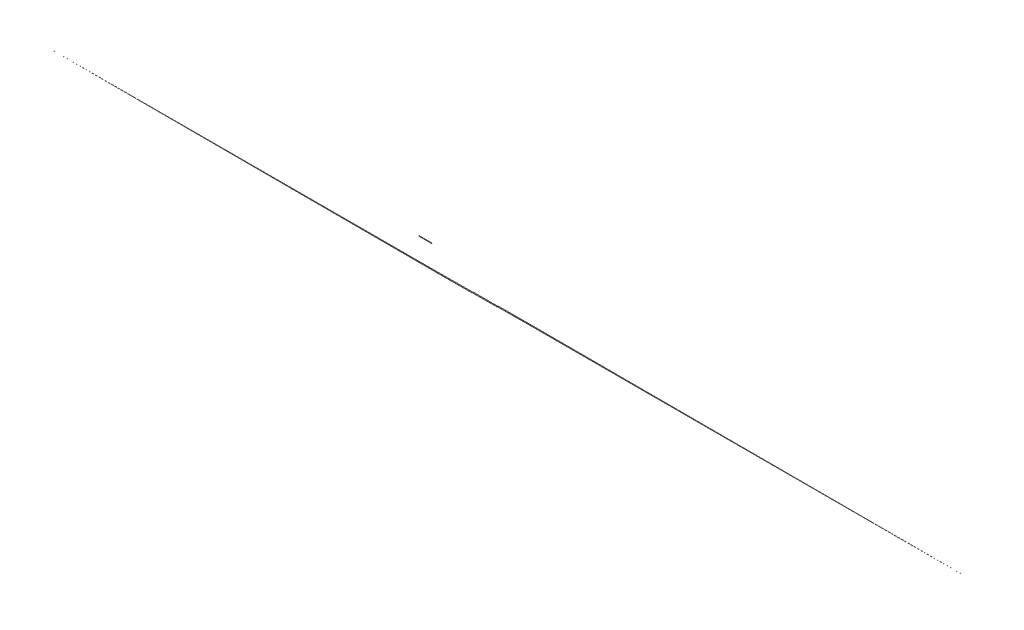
from build123d import *

# Parameters (mm, degrees)
BOSS_EXTRU_1_DEPTH           = 75
BOSS_EXTRU_1_2_DEPTH         = 75
BOSS_EXTRU_1_3_DEPTH         = 75
BOSS_EXTRU_1_4_DEPTH         = 75
BOSS_EXTRU_1_5_DEPTH         = 75
ENL_V_MAT_EXTRU_1_DEPTH      = 61264.080274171
ENL_V_MAT_EXTRU_1_DEPTH_BACK = 61264.080274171
ESQUISSE2_W                  = 61283
ESQUISSE2_H                  = 170
ESQUISSE3_W                  = 854.54917265
ESQUISSE3_H                  = 31.077532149
BOSS_EXTRU_2_DEPTH           = 5


with BuildPart() as part:
    # Esquisse1 → Boss.-Extru.1 (new, symmetric)
    with BuildSketch(Plane.XY):
        Polygon((0, 0), (-29328, 2.93280001), (-29328, -2.93280001), align=None)
    extrude(amount=BOSS_EXTRU_1_DEPTH, both=True)


with BuildPart() as body_2:
    # Esquisse1 → Boss.-Extru.1 2 (new, symmetric)
    with BuildSketch(Plane.XY):
        Polygon((-31567, -12.68600842), (-29332, -2.941346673), (-29332.024987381, 2.924200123), (-31567.026891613, -6.373461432), align=None)
    extrude(amount=BOSS_EXTRU_1_2_DEPTH, both=True)


with BuildPart() as body_3:
    # Esquisse1 → Boss.-Extru.1 3 (new, symmetric)
    with BuildSketch(Plane.XY):
        Polygon((-31587, -32.771571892), (-31587.026891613, -26.459024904), (-33209, -33.206471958), (-33208.971726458, -39.843413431), align=None)
    extrude(amount=BOSS_EXTRU_1_3_DEPTH, both=True)


with BuildPart() as body_4:
    # Esquisse1 → Boss.-Extru.1 4 (new, symmetric)
    with BuildSketch(Plane.XY):
        Polygon((-33229, -54.9288705), (-33229.028273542, -48.291929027), (-35632.025850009, -58.813216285), (-35632, -64.881256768), align=None)
    extrude(amount=BOSS_EXTRU_1_4_DEPTH, both=True)


with BuildPart() as body_5:
    # Esquisse1 → Boss.-Extru.1 5 (new, symmetric)
    with BuildSketch(Plane.XY):
        Polygon((-61263, -61.855701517), (-35636, -58.821653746), (-35636, -64.889749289), align=None)
    extrude(amount=BOSS_EXTRU_1_5_DEPTH, both=True)


with BuildPart() as enl_v_mat_extru_1_tool:
    # Esquisse2 → Enl_v. mat.-Extru.1 (new, two sides: drawn at the far end of the back side and taken through both)
    with BuildSketch(Plane(origin=(0, 0, 0), x_dir=(1, 0, 0), z_dir=(0, 1, 0)).offset(-ENL_V_MAT_EXTRU_1_DEPTH_BACK)):
        with Locations((-30631.5, 0)):
            Rectangle(ESQUISSE2_W, ESQUISSE2_H)
        Polygon((0, 0), (-33219, 33.219011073), (-61263, 0), (-33219, -33.219011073), align=None, mode=Mode.SUBTRACT)
    extrude(amount=ENL_V_MAT_EXTRU_1_DEPTH + ENL_V_MAT_EXTRU_1_DEPTH_BACK)


with BuildPart() as part_1:
    add(part.part)

    # Enl_v. mat.-Extru.1: cut by enl_v_mat_extru_1_tool
    add(enl_v_mat_extru_1_tool.part, mode=Mode.SUBTRACT)


with BuildPart() as body_2_1:
    add(body_2.part)

    # Enl_v. mat.-Extru.1: cut by enl_v_mat_extru_1_tool
    add(enl_v_mat_extru_1_tool.part, mode=Mode.SUBTRACT)


with BuildPart() as body_3_1:
    add(body_3.part)

    # Enl_v. mat.-Extru.1: cut by enl_v_mat_extru_1_tool
    add(enl_v_mat_extru_1_tool.part, mode=Mode.SUBTRACT)


with BuildPart() as body_4_1:
    add(body_4.part)

    # Enl_v. mat.-Extru.1: cut by enl_v_mat_extru_1_tool
    add(enl_v_mat_extru_1_tool.part, mode=Mode.SUBTRACT)


with BuildPart() as body_5_1:
    add(body_5.part)

    # Enl_v. mat.-Extru.1: cut by enl_v_mat_extru_1_tool
    add(enl_v_mat_extru_1_tool.part, mode=Mode.SUBTRACT)


with BuildPart() as body_6:
    # Esquisse3 → Boss.-Extru.2 (new, symmetric)
    with BuildSketch(Plane.XY):
        with Locations((-36324.987825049, 1415.538766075)):
            Rectangle(ESQUISSE3_W, ESQUISSE3_H)
    extrude(amount=BOSS_EXTRU_2_DEPTH, both=True)


solid = Compound([part_1.part, body_2_1.part, body_3_1.part, body_4_1.part, body_5_1.part, body_6.part])
